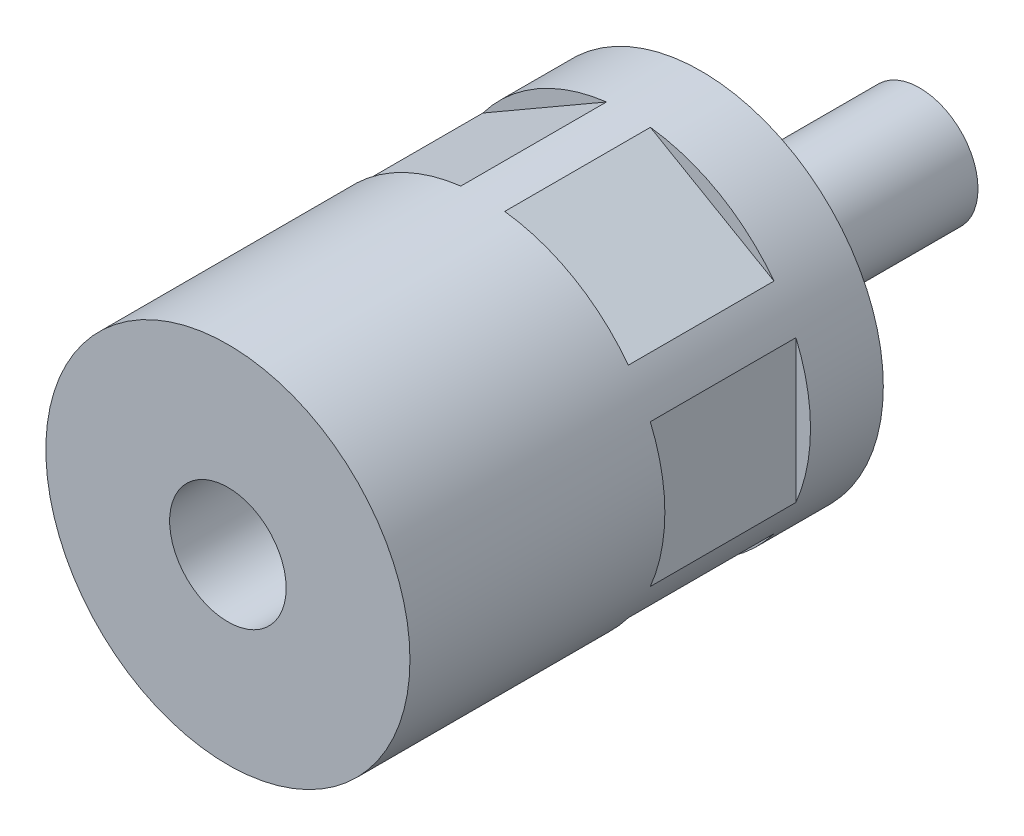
ISO-10303-21;
HEADER;
FILE_DESCRIPTION(('STEP AP214'),'2;1');
FILE_NAME('part.step','',(''),(''),'','','');
FILE_SCHEMA(('AUTOMOTIVE_DESIGN { 1 0 10303 214 1 1 1 1 }'));
ENDSEC;
DATA;
#1=APPLICATION_CONTEXT('core data for automotive mechanical design processes');
#2=APPLICATION_PROTOCOL_DEFINITION('international standard','automotive_design',2000,#1);
#3=PRODUCT_CONTEXT('',#1,'mechanical');
#4=PRODUCT('Part','Part','',(#3));
#5=PRODUCT_RELATED_PRODUCT_CATEGORY('part','',(#4));
#6=PRODUCT_DEFINITION_FORMATION('','',#4);
#7=PRODUCT_DEFINITION_CONTEXT('part definition',#1,'design');
#8=PRODUCT_DEFINITION('design','',#6,#7);
#9=PRODUCT_DEFINITION_SHAPE('','',#8);
#10=(LENGTH_UNIT() NAMED_UNIT(*) SI_UNIT(.MILLI.,.METRE.));
#11=(NAMED_UNIT(*) PLANE_ANGLE_UNIT() SI_UNIT($,.RADIAN.));
#12=(NAMED_UNIT(*) SI_UNIT($,.STERADIAN.) SOLID_ANGLE_UNIT());
#13=UNCERTAINTY_MEASURE_WITH_UNIT(LENGTH_MEASURE(1.E-05),#10,'distance_accuracy_value','');
#14=(GEOMETRIC_REPRESENTATION_CONTEXT(3) GLOBAL_UNCERTAINTY_ASSIGNED_CONTEXT((#13)) GLOBAL_UNIT_ASSIGNED_CONTEXT((#10,
#11,#12)) REPRESENTATION_CONTEXT('',''));
#15=CARTESIAN_POINT('',(0.,0.,0.));
#16=DIRECTION('',(0.,0.,1.));
#17=DIRECTION('',(1.,0.,0.));
#18=AXIS2_PLACEMENT_3D('',#15,#16,#17);
#19=CARTESIAN_POINT('',(0.,0.,80.));
#20=DIRECTION('',(0.,0.,1.));
#21=DIRECTION('',(1.,0.,0.));
#22=AXIS2_PLACEMENT_3D('',#19,#20,#21);
#23=CYLINDRICAL_SURFACE('',#22,25.);
#24=CARTESIAN_POINT('',(0.,0.,10.));
#25=DIRECTION('',(0.,0.,1.));
#26=DIRECTION('',(1.,0.,0.));
#27=AXIS2_PLACEMENT_3D('',#24,#25,#26);
#28=CIRCLE('',#27,25.);
#29=CARTESIAN_POINT('',(-19.9852813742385,-15.0196048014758,10.));
#30=VERTEX_POINT('',#29);
#31=CARTESIAN_POINT('',(-3.01471862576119,-24.8175637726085,10.));
#32=VERTEX_POINT('',#31);
#33=EDGE_CURVE('E152',#30,#32,#28,.T.);
#34=ORIENTED_EDGE('',*,*,#33,.F.);
#35=DIRECTION('',(0.,0.,1.));
#36=VECTOR('',#35,1.);
#37=CARTESIAN_POINT('',(-19.9852813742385,-15.0196048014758,80.));
#38=LINE('',#37,#36);
#39=CARTESIAN_POINT('',(-19.9852813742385,-15.0196048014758,30.));
#40=VERTEX_POINT('',#39);
#41=EDGE_CURVE('E9',#30,#40,#38,.T.);
#42=ORIENTED_EDGE('',*,*,#41,.T.);
#43=CARTESIAN_POINT('',(0.,0.,30.));
#44=DIRECTION('',(0.,0.,1.));
#45=DIRECTION('',(1.,0.,0.));
#46=AXIS2_PLACEMENT_3D('',#43,#44,#45);
#47=CIRCLE('',#46,25.);
#48=CARTESIAN_POINT('',(-3.01471862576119,-24.8175637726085,30.));
#49=VERTEX_POINT('',#48);
#50=EDGE_CURVE('E22',#40,#49,#47,.T.);
#51=ORIENTED_EDGE('',*,*,#50,.T.);
#52=DIRECTION('',(0.,0.,1.));
#53=VECTOR('',#52,1.);
#54=CARTESIAN_POINT('',(-3.01471862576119,-24.8175637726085,80.));
#55=LINE('',#54,#53);
#56=EDGE_CURVE('E149',#49,#32,#55,.F.);
#57=ORIENTED_EDGE('',*,*,#56,.T.);
#58=EDGE_LOOP('',(#34,#42,#51,#57));
#59=FACE_BOUND('',#58,.T.);
#60=DIRECTION('',(0.,0.,1.));
#61=VECTOR('',#60,1.);
#62=CARTESIAN_POINT('',(23.,9.7979589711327,80.));
#63=LINE('',#62,#61);
#64=CARTESIAN_POINT('',(23.,9.7979589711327,10.));
#65=VERTEX_POINT('',#64);
#66=CARTESIAN_POINT('',(23.,9.7979589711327,30.));
#67=VERTEX_POINT('',#66);
#68=EDGE_CURVE('E142',#65,#67,#63,.T.);
#69=ORIENTED_EDGE('',*,*,#68,.F.);
#70=CARTESIAN_POINT('',(23.,-9.79795897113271,10.));
#71=VERTEX_POINT('',#70);
#72=EDGE_CURVE('E141',#71,#65,#28,.T.);
#73=ORIENTED_EDGE('',*,*,#72,.F.);
#74=DIRECTION('',(0.,0.,1.));
#75=VECTOR('',#74,1.);
#76=CARTESIAN_POINT('',(23.,-9.79795897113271,80.));
#77=LINE('',#76,#75);
#78=CARTESIAN_POINT('',(23.,-9.79795897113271,30.));
#79=VERTEX_POINT('',#78);
#80=EDGE_CURVE('E138',#79,#71,#77,.F.);
#81=ORIENTED_EDGE('',*,*,#80,.F.);
#82=EDGE_CURVE('E145',#79,#67,#47,.T.);
#83=ORIENTED_EDGE('',*,*,#82,.T.);
#84=EDGE_LOOP('',(#69,#73,#81,#83));
#85=FACE_BOUND('',#84,.T.);
#86=CARTESIAN_POINT('',(19.9852813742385,15.0196048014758,10.));
#87=VERTEX_POINT('',#86);
#88=CARTESIAN_POINT('',(3.01471862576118,24.8175637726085,10.));
#89=VERTEX_POINT('',#88);
#90=EDGE_CURVE('E134',#87,#89,#28,.T.);
#91=ORIENTED_EDGE('',*,*,#90,.F.);
#92=DIRECTION('',(0.,0.,1.));
#93=VECTOR('',#92,1.);
#94=CARTESIAN_POINT('',(19.9852813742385,15.0196048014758,80.));
#95=LINE('',#94,#93);
#96=CARTESIAN_POINT('',(19.9852813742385,15.0196048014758,30.));
#97=VERTEX_POINT('',#96);
#98=EDGE_CURVE('E135',#87,#97,#95,.T.);
#99=ORIENTED_EDGE('',*,*,#98,.T.);
#100=CARTESIAN_POINT('',(3.01471862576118,24.8175637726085,30.));
#101=VERTEX_POINT('',#100);
#102=EDGE_CURVE('E139',#97,#101,#47,.T.);
#103=ORIENTED_EDGE('',*,*,#102,.T.);
#104=DIRECTION('',(0.,0.,1.));
#105=VECTOR('',#104,1.);
#106=CARTESIAN_POINT('',(3.01471862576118,24.8175637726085,80.));
#107=LINE('',#106,#105);
#108=EDGE_CURVE('E131',#101,#89,#107,.F.);
#109=ORIENTED_EDGE('',*,*,#108,.T.);
#110=EDGE_LOOP('',(#91,#99,#103,#109));
#111=FACE_BOUND('',#110,.T.);
#112=CARTESIAN_POINT('',(0.,0.,0.));
#113=DIRECTION('',(0.,0.,1.));
#114=DIRECTION('',(1.,0.,0.));
#115=AXIS2_PLACEMENT_3D('',#112,#113,#114);
#116=CIRCLE('',#115,25.);
#117=CARTESIAN_POINT('',(25.,0.,0.));
#118=VERTEX_POINT('',#117);
#119=EDGE_CURVE('E210',#118,#118,#116,.T.);
#120=ORIENTED_EDGE('',*,*,#119,.T.);
#121=EDGE_LOOP('',(#120));
#122=FACE_BOUND('',#121,.T.);
#123=CARTESIAN_POINT('',(0.,0.,65.));
#124=DIRECTION('',(0.,0.,1.));
#125=DIRECTION('',(1.,0.,0.));
#126=AXIS2_PLACEMENT_3D('',#123,#124,#125);
#127=CIRCLE('',#126,25.);
#128=CARTESIAN_POINT('',(25.,0.,65.));
#129=VERTEX_POINT('',#128);
#130=EDGE_CURVE('E213',#129,#129,#127,.T.);
#131=ORIENTED_EDGE('',*,*,#130,.F.);
#132=EDGE_LOOP('',(#131));
#133=FACE_BOUND('',#132,.T.);
#134=CARTESIAN_POINT('',(-23.,9.79795897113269,10.));
#135=VERTEX_POINT('',#134);
#136=CARTESIAN_POINT('',(-23.,-9.79795897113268,10.));
#137=VERTEX_POINT('',#136);
#138=EDGE_CURVE('E111',#135,#137,#28,.T.);
#139=ORIENTED_EDGE('',*,*,#138,.F.);
#140=DIRECTION('',(0.,0.,1.));
#141=VECTOR('',#140,1.);
#142=CARTESIAN_POINT('',(-23.,9.79795897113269,80.));
#143=LINE('',#142,#141);
#144=CARTESIAN_POINT('',(-23.,9.79795897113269,30.));
#145=VERTEX_POINT('',#144);
#146=EDGE_CURVE('E110',#135,#145,#143,.T.);
#147=ORIENTED_EDGE('',*,*,#146,.T.);
#148=CARTESIAN_POINT('',(-23.,-9.79795897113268,30.));
#149=VERTEX_POINT('',#148);
#150=EDGE_CURVE('E103',#145,#149,#47,.T.);
#151=ORIENTED_EDGE('',*,*,#150,.T.);
#152=DIRECTION('',(0.,0.,1.));
#153=VECTOR('',#152,1.);
#154=CARTESIAN_POINT('',(-23.,-9.79795897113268,80.));
#155=LINE('',#154,#153);
#156=EDGE_CURVE('E117',#149,#137,#155,.F.);
#157=ORIENTED_EDGE('',*,*,#156,.T.);
#158=EDGE_LOOP('',(#139,#147,#151,#157));
#159=FACE_BOUND('',#158,.T.);
#160=DIRECTION('',(0.,0.,1.));
#161=VECTOR('',#160,1.);
#162=CARTESIAN_POINT('',(-19.9852813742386,15.0196048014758,80.));
#163=LINE('',#162,#161);
#164=CARTESIAN_POINT('',(-19.9852813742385,15.0196048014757,10.));
#165=VERTEX_POINT('',#164);
#166=CARTESIAN_POINT('',(-19.9852813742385,15.0196048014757,30.));
#167=VERTEX_POINT('',#166);
#168=EDGE_CURVE('E129',#165,#167,#163,.T.);
#169=ORIENTED_EDGE('',*,*,#168,.F.);
#170=CARTESIAN_POINT('',(-3.01471862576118,24.8175637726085,10.));
#171=VERTEX_POINT('',#170);
#172=EDGE_CURVE('E125',#171,#165,#28,.T.);
#173=ORIENTED_EDGE('',*,*,#172,.F.);
#174=DIRECTION('',(0.,0.,1.));
#175=VECTOR('',#174,1.);
#176=CARTESIAN_POINT('',(-3.0147186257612,24.8175637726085,80.));
#177=LINE('',#176,#175);
#178=CARTESIAN_POINT('',(-3.0147186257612,24.8175637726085,30.));
#179=VERTEX_POINT('',#178);
#180=EDGE_CURVE('E123',#179,#171,#177,.F.);
#181=ORIENTED_EDGE('',*,*,#180,.F.);
#182=EDGE_CURVE('E113',#179,#167,#47,.T.);
#183=ORIENTED_EDGE('',*,*,#182,.T.);
#184=EDGE_LOOP('',(#169,#173,#181,#183));
#185=FACE_BOUND('',#184,.T.);
#186=DIRECTION('',(0.,0.,1.));
#187=VECTOR('',#186,1.);
#188=CARTESIAN_POINT('',(19.9852813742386,-15.0196048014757,80.));
#189=LINE('',#188,#187);
#190=CARTESIAN_POINT('',(19.9852813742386,-15.0196048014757,10.));
#191=VERTEX_POINT('',#190);
#192=CARTESIAN_POINT('',(19.9852813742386,-15.0196048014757,30.));
#193=VERTEX_POINT('',#192);
#194=EDGE_CURVE('E148',#191,#193,#189,.T.);
#195=ORIENTED_EDGE('',*,*,#194,.F.);
#196=CARTESIAN_POINT('',(3.01471862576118,-24.8175637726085,10.));
#197=VERTEX_POINT('',#196);
#198=EDGE_CURVE('E147',#197,#191,#28,.T.);
#199=ORIENTED_EDGE('',*,*,#198,.F.);
#200=DIRECTION('',(0.,0.,1.));
#201=VECTOR('',#200,1.);
#202=CARTESIAN_POINT('',(3.01471862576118,-24.8175637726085,80.));
#203=LINE('',#202,#201);
#204=CARTESIAN_POINT('',(3.01471862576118,-24.8175637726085,30.));
#205=VERTEX_POINT('',#204);
#206=EDGE_CURVE('E144',#205,#197,#203,.F.);
#207=ORIENTED_EDGE('',*,*,#206,.F.);
#208=EDGE_CURVE('E150',#205,#193,#47,.T.);
#209=ORIENTED_EDGE('',*,*,#208,.T.);
#210=EDGE_LOOP('',(#195,#199,#207,#209));
#211=FACE_BOUND('',#210,.T.);
#212=ADVANCED_FACE('F14',(#59,#85,#111,#122,#133,#159,#185,#211),#23,.T.);
#213=CARTESIAN_POINT('',(0.,0.,-30.));
#214=DIRECTION('',(0.,0.,1.));
#215=DIRECTION('',(1.,0.,0.));
#216=AXIS2_PLACEMENT_3D('',#213,#214,#215);
#217=PLANE('',#216);
#218=CARTESIAN_POINT('',(0.,0.,-30.));
#219=DIRECTION('',(0.,0.,1.));
#220=DIRECTION('',(1.,0.,0.));
#221=AXIS2_PLACEMENT_3D('',#218,#219,#220);
#222=CIRCLE('',#221,8.);
#223=CARTESIAN_POINT('',(8.,0.,-30.));
#224=VERTEX_POINT('',#223);
#225=EDGE_CURVE('E190',#224,#224,#222,.T.);
#226=ORIENTED_EDGE('',*,*,#225,.F.);
#227=EDGE_LOOP('',(#226));
#228=FACE_BOUND('',#227,.T.);
#229=ADVANCED_FACE('F16',(#228),#217,.F.);
#230=CARTESIAN_POINT('',(0.,0.,80.));
#231=DIRECTION('',(0.,0.,1.));
#232=DIRECTION('',(1.,0.,0.));
#233=AXIS2_PLACEMENT_3D('',#230,#231,#232);
#234=CYLINDRICAL_SURFACE('',#233,8.);
#235=CARTESIAN_POINT('',(0.,0.,30.));
#236=DIRECTION('',(0.,0.,1.));
#237=DIRECTION('',(1.,0.,0.));
#238=AXIS2_PLACEMENT_3D('',#235,#236,#237);
#239=CIRCLE('',#238,8.);
#240=CARTESIAN_POINT('',(8.,0.,30.));
#241=VERTEX_POINT('',#240);
#242=EDGE_CURVE('E245',#241,#241,#239,.T.);
#243=ORIENTED_EDGE('',*,*,#242,.F.);
#244=EDGE_LOOP('',(#243));
#245=FACE_BOUND('',#244,.T.);
#246=CARTESIAN_POINT('',(0.,0.,65.));
#247=DIRECTION('',(0.,0.,1.));
#248=DIRECTION('',(1.,0.,0.));
#249=AXIS2_PLACEMENT_3D('',#246,#247,#248);
#250=CIRCLE('',#249,8.);
#251=CARTESIAN_POINT('',(8.,0.,65.));
#252=VERTEX_POINT('',#251);
#253=EDGE_CURVE('E159',#252,#252,#250,.T.);
#254=ORIENTED_EDGE('',*,*,#253,.T.);
#255=EDGE_LOOP('',(#254));
#256=FACE_BOUND('',#255,.T.);
#257=ADVANCED_FACE('F219',(#245,#256),#234,.F.);
#258=CARTESIAN_POINT('',(25.,0.,65.));
#259=DIRECTION('',(0.,0.,-1.));
#260=DIRECTION('',(-1.,0.,0.));
#261=AXIS2_PLACEMENT_3D('',#258,#259,#260);
#262=PLANE('',#261);
#263=ORIENTED_EDGE('',*,*,#253,.F.);
#264=EDGE_LOOP('',(#263));
#265=FACE_BOUND('',#264,.T.);
#266=ORIENTED_EDGE('',*,*,#130,.T.);
#267=EDGE_LOOP('',(#266));
#268=FACE_BOUND('',#267,.T.);
#269=ADVANCED_FACE('F221',(#265,#268),#262,.F.);
#270=CARTESIAN_POINT('',(25.,0.,0.));
#271=DIRECTION('',(0.,0.,-1.));
#272=DIRECTION('',(-1.,0.,0.));
#273=AXIS2_PLACEMENT_3D('',#270,#271,#272);
#274=PLANE('',#273);
#275=CARTESIAN_POINT('',(0.,0.,0.));
#276=DIRECTION('',(0.,0.,1.));
#277=DIRECTION('',(1.,0.,0.));
#278=AXIS2_PLACEMENT_3D('',#275,#276,#277);
#279=CIRCLE('',#278,6.5);
#280=CARTESIAN_POINT('',(6.5,0.,0.));
#281=VERTEX_POINT('',#280);
#282=EDGE_CURVE('E207',#281,#281,#279,.T.);
#283=ORIENTED_EDGE('',*,*,#282,.T.);
#284=EDGE_LOOP('',(#283));
#285=FACE_BOUND('',#284,.T.);
#286=ORIENTED_EDGE('',*,*,#119,.F.);
#287=EDGE_LOOP('',(#286));
#288=FACE_BOUND('',#287,.T.);
#289=ADVANCED_FACE('F224',(#285,#288),#274,.T.);
#290=CARTESIAN_POINT('',(0.,0.,80.));
#291=DIRECTION('',(0.,0.,1.));
#292=DIRECTION('',(1.,0.,0.));
#293=AXIS2_PLACEMENT_3D('',#290,#291,#292);
#294=CYLINDRICAL_SURFACE('',#293,6.5);
#295=CARTESIAN_POINT('',(0.,0.,-4.));
#296=DIRECTION('',(0.,0.,1.));
#297=DIRECTION('',(1.,0.,0.));
#298=AXIS2_PLACEMENT_3D('',#295,#296,#297);
#299=CIRCLE('',#298,6.5);
#300=CARTESIAN_POINT('',(6.5,0.,-4.));
#301=VERTEX_POINT('',#300);
#302=EDGE_CURVE('E204',#301,#301,#299,.T.);
#303=ORIENTED_EDGE('',*,*,#302,.T.);
#304=EDGE_LOOP('',(#303));
#305=FACE_BOUND('',#304,.T.);
#306=ORIENTED_EDGE('',*,*,#282,.F.);
#307=EDGE_LOOP('',(#306));
#308=FACE_BOUND('',#307,.T.);
#309=ADVANCED_FACE('F443',(#305,#308),#294,.T.);
#310=CARTESIAN_POINT('',(6.5,0.,-4.));
#311=DIRECTION('',(0.,0.,1.));
#312=DIRECTION('',(1.,0.,0.));
#313=AXIS2_PLACEMENT_3D('',#310,#311,#312);
#314=PLANE('',#313);
#315=CARTESIAN_POINT('',(0.,0.,-4.));
#316=DIRECTION('',(0.,0.,1.));
#317=DIRECTION('',(1.,0.,0.));
#318=AXIS2_PLACEMENT_3D('',#315,#316,#317);
#319=CIRCLE('',#318,8.);
#320=CARTESIAN_POINT('',(8.,0.,-4.));
#321=VERTEX_POINT('',#320);
#322=EDGE_CURVE('E201',#321,#321,#319,.T.);
#323=ORIENTED_EDGE('',*,*,#322,.T.);
#324=EDGE_LOOP('',(#323));
#325=FACE_BOUND('',#324,.T.);
#326=ORIENTED_EDGE('',*,*,#302,.F.);
#327=EDGE_LOOP('',(#326));
#328=FACE_BOUND('',#327,.T.);
#329=ADVANCED_FACE('F339',(#325,#328),#314,.T.);
#330=CARTESIAN_POINT('',(0.,0.,80.));
#331=DIRECTION('',(0.,0.,1.));
#332=DIRECTION('',(1.,0.,0.));
#333=AXIS2_PLACEMENT_3D('',#330,#331,#332);
#334=CYLINDRICAL_SURFACE('',#333,8.);
#335=ORIENTED_EDGE('',*,*,#322,.F.);
#336=EDGE_LOOP('',(#335));
#337=FACE_BOUND('',#336,.T.);
#338=ORIENTED_EDGE('',*,*,#225,.T.);
#339=EDGE_LOOP('',(#338));
#340=FACE_BOUND('',#339,.T.);
#341=ADVANCED_FACE('F333',(#337,#340),#334,.T.);
#342=CARTESIAN_POINT('',(-23.,13.2790561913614,30.));
#343=DIRECTION('',(1.,0.,0.));
#344=DIRECTION('',(0.,1.,0.));
#345=AXIS2_PLACEMENT_3D('',#342,#343,#344);
#346=PLANE('',#345);
#347=DIRECTION('',(0.,-1.,0.));
#348=VECTOR('',#347,1.);
#349=CARTESIAN_POINT('',(-23.,13.2790561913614,10.));
#350=LINE('',#349,#348);
#351=EDGE_CURVE('E247',#135,#137,#350,.T.);
#352=ORIENTED_EDGE('',*,*,#351,.T.);
#353=ORIENTED_EDGE('',*,*,#156,.F.);
#354=DIRECTION('',(0.,-1.,0.));
#355=VECTOR('',#354,1.);
#356=CARTESIAN_POINT('',(-23.,13.2790561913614,30.));
#357=LINE('',#356,#355);
#358=EDGE_CURVE('E106',#145,#149,#357,.T.);
#359=ORIENTED_EDGE('',*,*,#358,.F.);
#360=ORIENTED_EDGE('',*,*,#146,.F.);
#361=EDGE_LOOP('',(#352,#353,#359,#360));
#362=FACE_BOUND('',#361,.T.);
#363=ADVANCED_FACE('F115',(#362),#346,.F.);
#364=CARTESIAN_POINT('',(0.,0.,10.));
#365=DIRECTION('',(0.,0.,1.));
#366=DIRECTION('',(1.,0.,0.));
#367=AXIS2_PLACEMENT_3D('',#364,#365,#366);
#368=PLANE('',#367);
#369=ORIENTED_EDGE('',*,*,#138,.T.);
#370=ORIENTED_EDGE('',*,*,#351,.F.);
#371=EDGE_LOOP('',(#369,#370));
#372=FACE_BOUND('',#371,.T.);
#373=ADVANCED_FACE('F281',(#372),#368,.T.);
#374=CARTESIAN_POINT('',(0.,0.,30.));
#375=DIRECTION('',(0.,0.,1.));
#376=DIRECTION('',(1.,0.,0.));
#377=AXIS2_PLACEMENT_3D('',#374,#375,#376);
#378=PLANE('',#377);
#379=ORIENTED_EDGE('',*,*,#358,.T.);
#380=ORIENTED_EDGE('',*,*,#150,.F.);
#381=EDGE_LOOP('',(#379,#380));
#382=FACE_BOUND('',#381,.T.);
#383=ADVANCED_FACE('F105',(#382),#378,.F.);
#384=CARTESIAN_POINT('',(-23.,13.2790561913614,30.));
#385=DIRECTION('',(-0.5,0.866025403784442,0.));
#386=DIRECTION('',(-0.866025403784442,-0.5,0.));
#387=AXIS2_PLACEMENT_3D('',#384,#385,#386);
#388=PLANE('',#387);
#389=ORIENTED_EDGE('',*,*,#168,.T.);
#390=DIRECTION('',(0.866025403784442,0.5,0.));
#391=VECTOR('',#390,1.);
#392=CARTESIAN_POINT('',(-23.,13.2790561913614,30.));
#393=LINE('',#392,#391);
#394=EDGE_CURVE('E118',#167,#179,#393,.T.);
#395=ORIENTED_EDGE('',*,*,#394,.T.);
#396=ORIENTED_EDGE('',*,*,#180,.T.);
#397=DIRECTION('',(0.866025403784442,0.5,0.));
#398=VECTOR('',#397,1.);
#399=CARTESIAN_POINT('',(-23.,13.2790561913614,10.));
#400=LINE('',#399,#398);
#401=EDGE_CURVE('E249',#165,#171,#400,.T.);
#402=ORIENTED_EDGE('',*,*,#401,.F.);
#403=EDGE_LOOP('',(#389,#395,#396,#402));
#404=FACE_BOUND('',#403,.T.);
#405=ADVANCED_FACE('F265',(#404),#388,.T.);
#406=ORIENTED_EDGE('',*,*,#172,.T.);
#407=ORIENTED_EDGE('',*,*,#401,.T.);
#408=EDGE_LOOP('',(#406,#407));
#409=FACE_BOUND('',#408,.T.);
#410=ADVANCED_FACE('F259',(#409),#368,.T.);
#411=ORIENTED_EDGE('',*,*,#394,.F.);
#412=ORIENTED_EDGE('',*,*,#182,.F.);
#413=EDGE_LOOP('',(#411,#412));
#414=FACE_BOUND('',#413,.T.);
#415=ADVANCED_FACE('F267',(#414),#378,.F.);
#416=CARTESIAN_POINT('',(23.,13.2790561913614,30.));
#417=DIRECTION('',(-0.499999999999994,-0.866025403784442,0.));
#418=DIRECTION('',(0.866025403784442,-0.499999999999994,0.));
#419=AXIS2_PLACEMENT_3D('',#416,#417,#418);
#420=PLANE('',#419);
#421=DIRECTION('',(-0.866025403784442,0.499999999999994,0.));
#422=VECTOR('',#421,1.);
#423=CARTESIAN_POINT('',(23.,13.2790561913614,10.));
#424=LINE('',#423,#422);
#425=EDGE_CURVE('E257',#87,#89,#424,.T.);
#426=ORIENTED_EDGE('',*,*,#425,.T.);
#427=ORIENTED_EDGE('',*,*,#108,.F.);
#428=DIRECTION('',(-0.866025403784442,0.499999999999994,0.));
#429=VECTOR('',#428,1.);
#430=CARTESIAN_POINT('',(23.,13.2790561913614,30.));
#431=LINE('',#430,#429);
#432=EDGE_CURVE('E192',#97,#101,#431,.T.);
#433=ORIENTED_EDGE('',*,*,#432,.F.);
#434=ORIENTED_EDGE('',*,*,#98,.F.);
#435=EDGE_LOOP('',(#426,#427,#433,#434));
#436=FACE_BOUND('',#435,.T.);
#437=ADVANCED_FACE('F269',(#436),#420,.F.);
#438=ORIENTED_EDGE('',*,*,#90,.T.);
#439=ORIENTED_EDGE('',*,*,#425,.F.);
#440=EDGE_LOOP('',(#438,#439));
#441=FACE_BOUND('',#440,.T.);
#442=ADVANCED_FACE('F277',(#441),#368,.T.);
#443=ORIENTED_EDGE('',*,*,#432,.T.);
#444=ORIENTED_EDGE('',*,*,#102,.F.);
#445=EDGE_LOOP('',(#443,#444));
#446=FACE_BOUND('',#445,.T.);
#447=ADVANCED_FACE('F271',(#446),#378,.F.);
#448=CARTESIAN_POINT('',(23.,13.2790561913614,30.));
#449=DIRECTION('',(1.,0.,0.));
#450=DIRECTION('',(0.,1.,0.));
#451=AXIS2_PLACEMENT_3D('',#448,#449,#450);
#452=PLANE('',#451);
#453=ORIENTED_EDGE('',*,*,#68,.T.);
#454=DIRECTION('',(0.,-1.,0.));
#455=VECTOR('',#454,1.);
#456=CARTESIAN_POINT('',(23.,13.2790561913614,30.));
#457=LINE('',#456,#455);
#458=EDGE_CURVE('E187',#67,#79,#457,.T.);
#459=ORIENTED_EDGE('',*,*,#458,.T.);
#460=ORIENTED_EDGE('',*,*,#80,.T.);
#461=DIRECTION('',(0.,-1.,0.));
#462=VECTOR('',#461,1.);
#463=CARTESIAN_POINT('',(23.,13.2790561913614,10.));
#464=LINE('',#463,#462);
#465=EDGE_CURVE('E256',#65,#71,#464,.T.);
#466=ORIENTED_EDGE('',*,*,#465,.F.);
#467=EDGE_LOOP('',(#453,#459,#460,#466));
#468=FACE_BOUND('',#467,.T.);
#469=ADVANCED_FACE('F286',(#468),#452,.T.);
#470=ORIENTED_EDGE('',*,*,#72,.T.);
#471=ORIENTED_EDGE('',*,*,#465,.T.);
#472=EDGE_LOOP('',(#470,#471));
#473=FACE_BOUND('',#472,.T.);
#474=ADVANCED_FACE('F294',(#473),#368,.T.);
#475=ORIENTED_EDGE('',*,*,#458,.F.);
#476=ORIENTED_EDGE('',*,*,#82,.F.);
#477=EDGE_LOOP('',(#475,#476));
#478=FACE_BOUND('',#477,.T.);
#479=ADVANCED_FACE('F288',(#478),#378,.F.);
#480=CARTESIAN_POINT('',(23.,-13.2790561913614,30.));
#481=DIRECTION('',(0.5,-0.866025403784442,0.));
#482=DIRECTION('',(0.866025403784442,0.5,0.));
#483=AXIS2_PLACEMENT_3D('',#480,#481,#482);
#484=PLANE('',#483);
#485=ORIENTED_EDGE('',*,*,#194,.T.);
#486=DIRECTION('',(-0.866025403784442,-0.5,0.));
#487=VECTOR('',#486,1.);
#488=CARTESIAN_POINT('',(23.,-13.2790561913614,30.));
#489=LINE('',#488,#487);
#490=EDGE_CURVE('E37',#193,#205,#489,.T.);
#491=ORIENTED_EDGE('',*,*,#490,.T.);
#492=ORIENTED_EDGE('',*,*,#206,.T.);
#493=DIRECTION('',(-0.866025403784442,-0.5,0.));
#494=VECTOR('',#493,1.);
#495=CARTESIAN_POINT('',(23.,-13.2790561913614,10.));
#496=LINE('',#495,#494);
#497=EDGE_CURVE('E253',#191,#197,#496,.T.);
#498=ORIENTED_EDGE('',*,*,#497,.F.);
#499=EDGE_LOOP('',(#485,#491,#492,#498));
#500=FACE_BOUND('',#499,.T.);
#501=ADVANCED_FACE('F298',(#500),#484,.T.);
#502=ORIENTED_EDGE('',*,*,#198,.T.);
#503=ORIENTED_EDGE('',*,*,#497,.T.);
#504=EDGE_LOOP('',(#502,#503));
#505=FACE_BOUND('',#504,.T.);
#506=ADVANCED_FACE('F305',(#505),#368,.T.);
#507=ORIENTED_EDGE('',*,*,#490,.F.);
#508=ORIENTED_EDGE('',*,*,#208,.F.);
#509=EDGE_LOOP('',(#507,#508));
#510=FACE_BOUND('',#509,.T.);
#511=ADVANCED_FACE('F185',(#510),#378,.F.);
#512=DIRECTION('',(0.866025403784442,-0.5,0.));
#513=VECTOR('',#512,1.);
#514=CARTESIAN_POINT('',(-23.,-13.2790561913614,30.));
#515=LINE('',#514,#513);
#516=EDGE_CURVE('E186',#40,#49,#515,.T.);
#517=ORIENTED_EDGE('',*,*,#516,.T.);
#518=ORIENTED_EDGE('',*,*,#50,.F.);
#519=EDGE_LOOP('',(#517,#518));
#520=FACE_BOUND('',#519,.T.);
#521=ADVANCED_FACE('F284',(#520),#378,.F.);
#522=ORIENTED_EDGE('',*,*,#33,.T.);
#523=DIRECTION('',(0.866025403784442,-0.5,0.));
#524=VECTOR('',#523,1.);
#525=CARTESIAN_POINT('',(-23.,-13.2790561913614,10.));
#526=LINE('',#525,#524);
#527=EDGE_CURVE('E29',#30,#32,#526,.T.);
#528=ORIENTED_EDGE('',*,*,#527,.F.);
#529=EDGE_LOOP('',(#522,#528));
#530=FACE_BOUND('',#529,.T.);
#531=ADVANCED_FACE('F314',(#530),#368,.T.);
#532=CARTESIAN_POINT('',(-23.,-13.2790561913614,30.));
#533=DIRECTION('',(0.5,0.866025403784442,0.));
#534=DIRECTION('',(-0.866025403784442,0.5,0.));
#535=AXIS2_PLACEMENT_3D('',#532,#533,#534);
#536=PLANE('',#535);
#537=ORIENTED_EDGE('',*,*,#527,.T.);
#538=ORIENTED_EDGE('',*,*,#56,.F.);
#539=ORIENTED_EDGE('',*,*,#516,.F.);
#540=ORIENTED_EDGE('',*,*,#41,.F.);
#541=EDGE_LOOP('',(#537,#538,#539,#540));
#542=FACE_BOUND('',#541,.T.);
#543=ADVANCED_FACE('F321',(#542),#536,.F.);
#544=CARTESIAN_POINT('',(0.,0.,30.));
#545=DIRECTION('',(0.,0.,1.));
#546=DIRECTION('',(1.,0.,0.));
#547=AXIS2_PLACEMENT_3D('',#544,#545,#546);
#548=PLANE('',#547);
#549=ORIENTED_EDGE('',*,*,#242,.T.);
#550=EDGE_LOOP('',(#549));
#551=FACE_BOUND('',#550,.T.);
#552=ADVANCED_FACE('F326',(#551),#548,.T.);
#553=CLOSED_SHELL('',(#212,#229,#257,#269,#289,#309,#329,#341,#363,#373,#383,#405,#410,#415,
#437,#442,#447,#469,#474,#479,#501,#506,#511,#521,#531,#543,#552));
#554=MANIFOLD_SOLID_BREP('B1',#553);
#555=ADVANCED_BREP_SHAPE_REPRESENTATION('',(#18,#554),#14);
#556=SHAPE_DEFINITION_REPRESENTATION(#9,#555);
ENDSEC;
END-ISO-10303-21;
